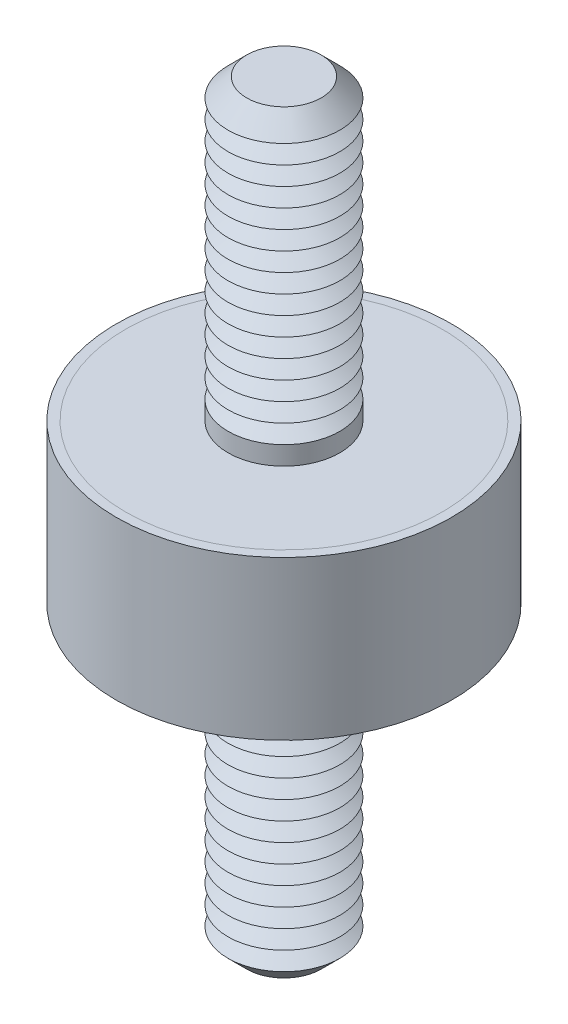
ISO-10303-21;
HEADER;
FILE_DESCRIPTION(('STEP AP214'),'2;1');
FILE_NAME('part.step','',(''),(''),'','','');
FILE_SCHEMA(('AUTOMOTIVE_DESIGN { 1 0 10303 214 1 1 1 1 }'));
ENDSEC;
DATA;
#1=APPLICATION_CONTEXT('core data for automotive mechanical design processes');
#2=APPLICATION_PROTOCOL_DEFINITION('international standard','automotive_design',2000,#1);
#3=PRODUCT_CONTEXT('',#1,'mechanical');
#4=PRODUCT('Part','Part','',(#3));
#5=PRODUCT_RELATED_PRODUCT_CATEGORY('part','',(#4));
#6=PRODUCT_DEFINITION_FORMATION('','',#4);
#7=PRODUCT_DEFINITION_CONTEXT('part definition',#1,'design');
#8=PRODUCT_DEFINITION('design','',#6,#7);
#9=PRODUCT_DEFINITION_SHAPE('','',#8);
#10=(LENGTH_UNIT() NAMED_UNIT(*) SI_UNIT(.MILLI.,.METRE.));
#11=(NAMED_UNIT(*) PLANE_ANGLE_UNIT() SI_UNIT($,.RADIAN.));
#12=(NAMED_UNIT(*) SI_UNIT($,.STERADIAN.) SOLID_ANGLE_UNIT());
#13=UNCERTAINTY_MEASURE_WITH_UNIT(LENGTH_MEASURE(1.E-05),#10,'distance_accuracy_value','');
#14=(GEOMETRIC_REPRESENTATION_CONTEXT(3) GLOBAL_UNCERTAINTY_ASSIGNED_CONTEXT((#13)) GLOBAL_UNIT_ASSIGNED_CONTEXT((#10,
#11,#12)) REPRESENTATION_CONTEXT('',''));
#15=CARTESIAN_POINT('',(0.,0.,0.));
#16=DIRECTION('',(0.,0.,1.));
#17=DIRECTION('',(1.,0.,0.));
#18=AXIS2_PLACEMENT_3D('',#15,#16,#17);
#19=CARTESIAN_POINT('',(0.,-20.25,0.));
#20=DIRECTION('',(0.,1.,0.));
#21=DIRECTION('',(0.,0.,1.));
#22=AXIS2_PLACEMENT_3D('',#19,#20,#21);
#23=CYLINDRICAL_SURFACE('',#22,3.);
#24=CARTESIAN_POINT('',(0.,-4.25,0.));
#25=DIRECTION('',(0.,-1.,0.));
#26=DIRECTION('',(0.,0.,-1.));
#27=AXIS2_PLACEMENT_3D('',#24,#25,#26);
#28=CIRCLE('',#27,3.);
#29=CARTESIAN_POINT('',(0.,-4.25,-3.));
#30=VERTEX_POINT('',#29);
#31=EDGE_CURVE('P0_E21',#30,#30,#28,.T.);
#32=ORIENTED_EDGE('',*,*,#31,.T.);
#33=EDGE_LOOP('',(#32));
#34=FACE_BOUND('',#33,.T.);
#35=CARTESIAN_POINT('',(0.,-5.25,0.));
#36=DIRECTION('',(0.,1.,0.));
#37=DIRECTION('',(0.,0.,1.));
#38=AXIS2_PLACEMENT_3D('',#35,#36,#37);
#39=CIRCLE('',#38,3.);
#40=CARTESIAN_POINT('',(0.,-5.25,3.));
#41=VERTEX_POINT('',#40);
#42=EDGE_CURVE('P0_E33',#41,#41,#39,.T.);
#43=ORIENTED_EDGE('',*,*,#42,.T.);
#44=EDGE_LOOP('',(#43));
#45=FACE_BOUND('',#44,.T.);
#46=ADVANCED_FACE('P0_F14',(#34,#45),#23,.T.);
#47=CARTESIAN_POINT('',(0.,-4.25,0.));
#48=DIRECTION('',(0.,1.,0.));
#49=DIRECTION('',(0.,0.,1.));
#50=AXIS2_PLACEMENT_3D('',#47,#48,#49);
#51=CYLINDRICAL_SURFACE('',#50,8.5);
#52=CARTESIAN_POINT('',(0.,-4.25,0.));
#53=DIRECTION('',(0.,1.,0.));
#54=DIRECTION('',(0.,0.,1.));
#55=AXIS2_PLACEMENT_3D('',#52,#53,#54);
#56=CIRCLE('',#55,8.5);
#57=CARTESIAN_POINT('',(0.,-4.25,8.5));
#58=VERTEX_POINT('',#57);
#59=EDGE_CURVE('P0_E25',#58,#58,#56,.T.);
#60=ORIENTED_EDGE('',*,*,#59,.T.);
#61=EDGE_LOOP('',(#60));
#62=FACE_BOUND('',#61,.T.);
#63=CARTESIAN_POINT('',(0.,-3.75,0.));
#64=DIRECTION('',(0.,1.,0.));
#65=DIRECTION('',(0.,0.,1.));
#66=AXIS2_PLACEMENT_3D('',#63,#64,#65);
#67=CIRCLE('',#66,8.5);
#68=CARTESIAN_POINT('',(0.,-3.75,8.5));
#69=VERTEX_POINT('',#68);
#70=EDGE_CURVE('P0_E30',#69,#69,#67,.T.);
#71=ORIENTED_EDGE('',*,*,#70,.F.);
#72=EDGE_LOOP('',(#71));
#73=FACE_BOUND('',#72,.T.);
#74=ADVANCED_FACE('P0_F145',(#62,#73),#51,.T.);
#75=CARTESIAN_POINT('',(0.,-4.25,0.));
#76=DIRECTION('',(0.,1.,0.));
#77=DIRECTION('',(0.,0.,1.));
#78=AXIS2_PLACEMENT_3D('',#75,#76,#77);
#79=PLANE('',#78);
#80=ORIENTED_EDGE('',*,*,#31,.F.);
#81=EDGE_LOOP('',(#80));
#82=FACE_BOUND('',#81,.T.);
#83=ORIENTED_EDGE('',*,*,#59,.F.);
#84=EDGE_LOOP('',(#83));
#85=FACE_BOUND('',#84,.T.);
#86=ADVANCED_FACE('P0_F150',(#82,#85),#79,.F.);
#87=CARTESIAN_POINT('',(0.,-3.75,0.));
#88=DIRECTION('',(0.,1.,0.));
#89=DIRECTION('',(0.,0.,1.));
#90=AXIS2_PLACEMENT_3D('',#87,#88,#89);
#91=PLANE('',#90);
#92=ORIENTED_EDGE('',*,*,#70,.T.);
#93=EDGE_LOOP('',(#92));
#94=FACE_BOUND('',#93,.T.);
#95=ADVANCED_FACE('P0_F156',(#94),#91,.T.);
#96=CARTESIAN_POINT('',(0.,-5.25,0.));
#97=DIRECTION('',(0.,1.,0.));
#98=DIRECTION('',(0.,0.,1.));
#99=AXIS2_PLACEMENT_3D('',#96,#97,#98);
#100=CONICAL_SURFACE('',#99,3.,1.0471975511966);
#101=CARTESIAN_POINT('',(0.,-5.75,0.));
#102=DIRECTION('',(0.,1.,0.));
#103=DIRECTION('',(0.,0.,1.));
#104=AXIS2_PLACEMENT_3D('',#101,#102,#103);
#105=CIRCLE('',#104,2.13397459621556);
#106=CARTESIAN_POINT('',(0.,-5.75,2.13397459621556));
#107=VERTEX_POINT('',#106);
#108=EDGE_CURVE('P0_E39',#107,#107,#105,.T.);
#109=ORIENTED_EDGE('',*,*,#108,.T.);
#110=EDGE_LOOP('',(#109));
#111=FACE_BOUND('',#110,.T.);
#112=ORIENTED_EDGE('',*,*,#42,.F.);
#113=EDGE_LOOP('',(#112));
#114=FACE_BOUND('',#113,.T.);
#115=ADVANCED_FACE('P0_F159',(#111,#114),#100,.T.);
#116=CARTESIAN_POINT('',(0.,-5.75,0.));
#117=DIRECTION('',(0.,-1.,0.));
#118=DIRECTION('',(0.,0.,-1.));
#119=AXIS2_PLACEMENT_3D('',#116,#117,#118);
#120=CONICAL_SURFACE('',#119,2.13397459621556,1.0471975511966);
#121=CARTESIAN_POINT('',(0.,-6.25,0.));
#122=DIRECTION('',(0.,1.,0.));
#123=DIRECTION('',(0.,0.,1.));
#124=AXIS2_PLACEMENT_3D('',#121,#122,#123);
#125=CIRCLE('',#124,3.);
#126=CARTESIAN_POINT('',(0.,-6.25,3.));
#127=VERTEX_POINT('',#126);
#128=EDGE_CURVE('P0_E43',#127,#127,#125,.T.);
#129=ORIENTED_EDGE('',*,*,#128,.T.);
#130=EDGE_LOOP('',(#129));
#131=FACE_BOUND('',#130,.T.);
#132=ORIENTED_EDGE('',*,*,#108,.F.);
#133=EDGE_LOOP('',(#132));
#134=FACE_BOUND('',#133,.T.);
#135=ADVANCED_FACE('P0_F163',(#131,#134),#120,.T.);
#136=CARTESIAN_POINT('',(0.,-6.25,0.));
#137=DIRECTION('',(0.,1.,0.));
#138=DIRECTION('',(0.,0.,1.));
#139=AXIS2_PLACEMENT_3D('',#136,#137,#138);
#140=CONICAL_SURFACE('',#139,3.,1.0471975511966);
#141=CARTESIAN_POINT('',(0.,-6.75,0.));
#142=DIRECTION('',(0.,1.,0.));
#143=DIRECTION('',(0.,0.,1.));
#144=AXIS2_PLACEMENT_3D('',#141,#142,#143);
#145=CIRCLE('',#144,2.13397459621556);
#146=CARTESIAN_POINT('',(0.,-6.75,2.13397459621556));
#147=VERTEX_POINT('',#146);
#148=EDGE_CURVE('P0_E47',#147,#147,#145,.T.);
#149=ORIENTED_EDGE('',*,*,#148,.T.);
#150=EDGE_LOOP('',(#149));
#151=FACE_BOUND('',#150,.T.);
#152=ORIENTED_EDGE('',*,*,#128,.F.);
#153=EDGE_LOOP('',(#152));
#154=FACE_BOUND('',#153,.T.);
#155=ADVANCED_FACE('P0_F167',(#151,#154),#140,.T.);
#156=CARTESIAN_POINT('',(0.,-6.75,0.));
#157=DIRECTION('',(0.,-1.,0.));
#158=DIRECTION('',(0.,0.,-1.));
#159=AXIS2_PLACEMENT_3D('',#156,#157,#158);
#160=CONICAL_SURFACE('',#159,2.13397459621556,1.0471975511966);
#161=CARTESIAN_POINT('',(0.,-7.25,0.));
#162=DIRECTION('',(0.,1.,0.));
#163=DIRECTION('',(0.,0.,1.));
#164=AXIS2_PLACEMENT_3D('',#161,#162,#163);
#165=CIRCLE('',#164,3.);
#166=CARTESIAN_POINT('',(0.,-7.25,3.));
#167=VERTEX_POINT('',#166);
#168=EDGE_CURVE('P0_E52',#167,#167,#165,.T.);
#169=ORIENTED_EDGE('',*,*,#168,.T.);
#170=EDGE_LOOP('',(#169));
#171=FACE_BOUND('',#170,.T.);
#172=ORIENTED_EDGE('',*,*,#148,.F.);
#173=EDGE_LOOP('',(#172));
#174=FACE_BOUND('',#173,.T.);
#175=ADVANCED_FACE('P0_F174',(#171,#174),#160,.T.);
#176=CARTESIAN_POINT('',(0.,-7.25,0.));
#177=DIRECTION('',(0.,1.,0.));
#178=DIRECTION('',(0.,0.,1.));
#179=AXIS2_PLACEMENT_3D('',#176,#177,#178);
#180=CONICAL_SURFACE('',#179,3.,1.0471975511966);
#181=CARTESIAN_POINT('',(0.,-7.75,0.));
#182=DIRECTION('',(0.,1.,0.));
#183=DIRECTION('',(0.,0.,1.));
#184=AXIS2_PLACEMENT_3D('',#181,#182,#183);
#185=CIRCLE('',#184,2.13397459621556);
#186=CARTESIAN_POINT('',(0.,-7.75,2.13397459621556));
#187=VERTEX_POINT('',#186);
#188=EDGE_CURVE('P0_E55',#187,#187,#185,.T.);
#189=ORIENTED_EDGE('',*,*,#188,.T.);
#190=EDGE_LOOP('',(#189));
#191=FACE_BOUND('',#190,.T.);
#192=ORIENTED_EDGE('',*,*,#168,.F.);
#193=EDGE_LOOP('',(#192));
#194=FACE_BOUND('',#193,.T.);
#195=ADVANCED_FACE('P0_F178',(#191,#194),#180,.T.);
#196=CARTESIAN_POINT('',(0.,-7.75,0.));
#197=DIRECTION('',(0.,-1.,0.));
#198=DIRECTION('',(0.,0.,-1.));
#199=AXIS2_PLACEMENT_3D('',#196,#197,#198);
#200=CONICAL_SURFACE('',#199,2.13397459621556,1.0471975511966);
#201=CARTESIAN_POINT('',(0.,-8.25,0.));
#202=DIRECTION('',(0.,1.,0.));
#203=DIRECTION('',(0.,0.,1.));
#204=AXIS2_PLACEMENT_3D('',#201,#202,#203);
#205=CIRCLE('',#204,3.);
#206=CARTESIAN_POINT('',(0.,-8.25,3.));
#207=VERTEX_POINT('',#206);
#208=EDGE_CURVE('P0_E58',#207,#207,#205,.T.);
#209=ORIENTED_EDGE('',*,*,#208,.T.);
#210=EDGE_LOOP('',(#209));
#211=FACE_BOUND('',#210,.T.);
#212=ORIENTED_EDGE('',*,*,#188,.F.);
#213=EDGE_LOOP('',(#212));
#214=FACE_BOUND('',#213,.T.);
#215=ADVANCED_FACE('P0_F182',(#211,#214),#200,.T.);
#216=CARTESIAN_POINT('',(0.,-8.25,0.));
#217=DIRECTION('',(0.,1.,0.));
#218=DIRECTION('',(0.,0.,1.));
#219=AXIS2_PLACEMENT_3D('',#216,#217,#218);
#220=CONICAL_SURFACE('',#219,3.,1.0471975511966);
#221=CARTESIAN_POINT('',(0.,-8.75,0.));
#222=DIRECTION('',(0.,1.,0.));
#223=DIRECTION('',(0.,0.,1.));
#224=AXIS2_PLACEMENT_3D('',#221,#222,#223);
#225=CIRCLE('',#224,2.13397459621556);
#226=CARTESIAN_POINT('',(0.,-8.75,2.13397459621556));
#227=VERTEX_POINT('',#226);
#228=EDGE_CURVE('P0_E61',#227,#227,#225,.T.);
#229=ORIENTED_EDGE('',*,*,#228,.T.);
#230=EDGE_LOOP('',(#229));
#231=FACE_BOUND('',#230,.T.);
#232=ORIENTED_EDGE('',*,*,#208,.F.);
#233=EDGE_LOOP('',(#232));
#234=FACE_BOUND('',#233,.T.);
#235=ADVANCED_FACE('P0_F186',(#231,#234),#220,.T.);
#236=CARTESIAN_POINT('',(0.,-8.75,0.));
#237=DIRECTION('',(0.,-1.,0.));
#238=DIRECTION('',(0.,0.,-1.));
#239=AXIS2_PLACEMENT_3D('',#236,#237,#238);
#240=CONICAL_SURFACE('',#239,2.13397459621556,1.0471975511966);
#241=CARTESIAN_POINT('',(0.,-9.25,0.));
#242=DIRECTION('',(0.,1.,0.));
#243=DIRECTION('',(0.,0.,1.));
#244=AXIS2_PLACEMENT_3D('',#241,#242,#243);
#245=CIRCLE('',#244,3.);
#246=CARTESIAN_POINT('',(0.,-9.25,3.));
#247=VERTEX_POINT('',#246);
#248=EDGE_CURVE('P0_E64',#247,#247,#245,.T.);
#249=ORIENTED_EDGE('',*,*,#248,.T.);
#250=EDGE_LOOP('',(#249));
#251=FACE_BOUND('',#250,.T.);
#252=ORIENTED_EDGE('',*,*,#228,.F.);
#253=EDGE_LOOP('',(#252));
#254=FACE_BOUND('',#253,.T.);
#255=ADVANCED_FACE('P0_F190',(#251,#254),#240,.T.);
#256=CARTESIAN_POINT('',(0.,-9.25,0.));
#257=DIRECTION('',(0.,1.,0.));
#258=DIRECTION('',(0.,0.,1.));
#259=AXIS2_PLACEMENT_3D('',#256,#257,#258);
#260=CONICAL_SURFACE('',#259,3.,1.0471975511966);
#261=CARTESIAN_POINT('',(0.,-9.75,0.));
#262=DIRECTION('',(0.,1.,0.));
#263=DIRECTION('',(0.,0.,1.));
#264=AXIS2_PLACEMENT_3D('',#261,#262,#263);
#265=CIRCLE('',#264,2.13397459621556);
#266=CARTESIAN_POINT('',(0.,-9.75,2.13397459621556));
#267=VERTEX_POINT('',#266);
#268=EDGE_CURVE('P0_E67',#267,#267,#265,.T.);
#269=ORIENTED_EDGE('',*,*,#268,.T.);
#270=EDGE_LOOP('',(#269));
#271=FACE_BOUND('',#270,.T.);
#272=ORIENTED_EDGE('',*,*,#248,.F.);
#273=EDGE_LOOP('',(#272));
#274=FACE_BOUND('',#273,.T.);
#275=ADVANCED_FACE('P0_F194',(#271,#274),#260,.T.);
#276=CARTESIAN_POINT('',(0.,-9.75,0.));
#277=DIRECTION('',(0.,-1.,0.));
#278=DIRECTION('',(0.,0.,-1.));
#279=AXIS2_PLACEMENT_3D('',#276,#277,#278);
#280=CONICAL_SURFACE('',#279,2.13397459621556,1.0471975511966);
#281=CARTESIAN_POINT('',(0.,-10.25,0.));
#282=DIRECTION('',(0.,1.,0.));
#283=DIRECTION('',(0.,0.,1.));
#284=AXIS2_PLACEMENT_3D('',#281,#282,#283);
#285=CIRCLE('',#284,3.);
#286=CARTESIAN_POINT('',(0.,-10.25,3.));
#287=VERTEX_POINT('',#286);
#288=EDGE_CURVE('P0_E70',#287,#287,#285,.T.);
#289=ORIENTED_EDGE('',*,*,#288,.T.);
#290=EDGE_LOOP('',(#289));
#291=FACE_BOUND('',#290,.T.);
#292=ORIENTED_EDGE('',*,*,#268,.F.);
#293=EDGE_LOOP('',(#292));
#294=FACE_BOUND('',#293,.T.);
#295=ADVANCED_FACE('P0_F198',(#291,#294),#280,.T.);
#296=CARTESIAN_POINT('',(0.,-10.25,0.));
#297=DIRECTION('',(0.,1.,0.));
#298=DIRECTION('',(0.,0.,1.));
#299=AXIS2_PLACEMENT_3D('',#296,#297,#298);
#300=CONICAL_SURFACE('',#299,3.,1.0471975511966);
#301=CARTESIAN_POINT('',(0.,-10.75,0.));
#302=DIRECTION('',(0.,1.,0.));
#303=DIRECTION('',(0.,0.,1.));
#304=AXIS2_PLACEMENT_3D('',#301,#302,#303);
#305=CIRCLE('',#304,2.13397459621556);
#306=CARTESIAN_POINT('',(0.,-10.75,2.13397459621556));
#307=VERTEX_POINT('',#306);
#308=EDGE_CURVE('P0_E73',#307,#307,#305,.T.);
#309=ORIENTED_EDGE('',*,*,#308,.T.);
#310=EDGE_LOOP('',(#309));
#311=FACE_BOUND('',#310,.T.);
#312=ORIENTED_EDGE('',*,*,#288,.F.);
#313=EDGE_LOOP('',(#312));
#314=FACE_BOUND('',#313,.T.);
#315=ADVANCED_FACE('P0_F202',(#311,#314),#300,.T.);
#316=CARTESIAN_POINT('',(0.,-10.75,0.));
#317=DIRECTION('',(0.,-1.,0.));
#318=DIRECTION('',(0.,0.,-1.));
#319=AXIS2_PLACEMENT_3D('',#316,#317,#318);
#320=CONICAL_SURFACE('',#319,2.13397459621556,1.0471975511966);
#321=CARTESIAN_POINT('',(0.,-11.25,0.));
#322=DIRECTION('',(0.,1.,0.));
#323=DIRECTION('',(0.,0.,1.));
#324=AXIS2_PLACEMENT_3D('',#321,#322,#323);
#325=CIRCLE('',#324,3.);
#326=CARTESIAN_POINT('',(0.,-11.25,3.));
#327=VERTEX_POINT('',#326);
#328=EDGE_CURVE('P0_E76',#327,#327,#325,.T.);
#329=ORIENTED_EDGE('',*,*,#328,.T.);
#330=EDGE_LOOP('',(#329));
#331=FACE_BOUND('',#330,.T.);
#332=ORIENTED_EDGE('',*,*,#308,.F.);
#333=EDGE_LOOP('',(#332));
#334=FACE_BOUND('',#333,.T.);
#335=ADVANCED_FACE('P0_F206',(#331,#334),#320,.T.);
#336=CARTESIAN_POINT('',(0.,-11.25,0.));
#337=DIRECTION('',(0.,1.,0.));
#338=DIRECTION('',(0.,0.,1.));
#339=AXIS2_PLACEMENT_3D('',#336,#337,#338);
#340=CONICAL_SURFACE('',#339,3.,1.0471975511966);
#341=CARTESIAN_POINT('',(0.,-11.75,0.));
#342=DIRECTION('',(0.,1.,0.));
#343=DIRECTION('',(0.,0.,1.));
#344=AXIS2_PLACEMENT_3D('',#341,#342,#343);
#345=CIRCLE('',#344,2.13397459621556);
#346=CARTESIAN_POINT('',(0.,-11.75,2.13397459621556));
#347=VERTEX_POINT('',#346);
#348=EDGE_CURVE('P0_E79',#347,#347,#345,.T.);
#349=ORIENTED_EDGE('',*,*,#348,.T.);
#350=EDGE_LOOP('',(#349));
#351=FACE_BOUND('',#350,.T.);
#352=ORIENTED_EDGE('',*,*,#328,.F.);
#353=EDGE_LOOP('',(#352));
#354=FACE_BOUND('',#353,.T.);
#355=ADVANCED_FACE('P0_F210',(#351,#354),#340,.T.);
#356=CARTESIAN_POINT('',(0.,-11.75,0.));
#357=DIRECTION('',(0.,-1.,0.));
#358=DIRECTION('',(0.,0.,-1.));
#359=AXIS2_PLACEMENT_3D('',#356,#357,#358);
#360=CONICAL_SURFACE('',#359,2.13397459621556,1.0471975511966);
#361=CARTESIAN_POINT('',(0.,-12.25,0.));
#362=DIRECTION('',(0.,1.,0.));
#363=DIRECTION('',(0.,0.,1.));
#364=AXIS2_PLACEMENT_3D('',#361,#362,#363);
#365=CIRCLE('',#364,3.);
#366=CARTESIAN_POINT('',(0.,-12.25,3.));
#367=VERTEX_POINT('',#366);
#368=EDGE_CURVE('P0_E82',#367,#367,#365,.T.);
#369=ORIENTED_EDGE('',*,*,#368,.T.);
#370=EDGE_LOOP('',(#369));
#371=FACE_BOUND('',#370,.T.);
#372=ORIENTED_EDGE('',*,*,#348,.F.);
#373=EDGE_LOOP('',(#372));
#374=FACE_BOUND('',#373,.T.);
#375=ADVANCED_FACE('P0_F214',(#371,#374),#360,.T.);
#376=CARTESIAN_POINT('',(0.,-12.25,0.));
#377=DIRECTION('',(0.,1.,0.));
#378=DIRECTION('',(0.,0.,1.));
#379=AXIS2_PLACEMENT_3D('',#376,#377,#378);
#380=CONICAL_SURFACE('',#379,3.,1.0471975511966);
#381=CARTESIAN_POINT('',(0.,-12.75,0.));
#382=DIRECTION('',(0.,1.,0.));
#383=DIRECTION('',(0.,0.,1.));
#384=AXIS2_PLACEMENT_3D('',#381,#382,#383);
#385=CIRCLE('',#384,2.13397459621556);
#386=CARTESIAN_POINT('',(0.,-12.75,2.13397459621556));
#387=VERTEX_POINT('',#386);
#388=EDGE_CURVE('P0_E85',#387,#387,#385,.T.);
#389=ORIENTED_EDGE('',*,*,#388,.T.);
#390=EDGE_LOOP('',(#389));
#391=FACE_BOUND('',#390,.T.);
#392=ORIENTED_EDGE('',*,*,#368,.F.);
#393=EDGE_LOOP('',(#392));
#394=FACE_BOUND('',#393,.T.);
#395=ADVANCED_FACE('P0_F218',(#391,#394),#380,.T.);
#396=CARTESIAN_POINT('',(0.,-12.75,0.));
#397=DIRECTION('',(0.,-1.,0.));
#398=DIRECTION('',(0.,0.,-1.));
#399=AXIS2_PLACEMENT_3D('',#396,#397,#398);
#400=CONICAL_SURFACE('',#399,2.13397459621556,1.0471975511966);
#401=CARTESIAN_POINT('',(0.,-13.25,0.));
#402=DIRECTION('',(0.,1.,0.));
#403=DIRECTION('',(0.,0.,1.));
#404=AXIS2_PLACEMENT_3D('',#401,#402,#403);
#405=CIRCLE('',#404,3.);
#406=CARTESIAN_POINT('',(0.,-13.25,3.));
#407=VERTEX_POINT('',#406);
#408=EDGE_CURVE('P0_E88',#407,#407,#405,.T.);
#409=ORIENTED_EDGE('',*,*,#408,.T.);
#410=EDGE_LOOP('',(#409));
#411=FACE_BOUND('',#410,.T.);
#412=ORIENTED_EDGE('',*,*,#388,.F.);
#413=EDGE_LOOP('',(#412));
#414=FACE_BOUND('',#413,.T.);
#415=ADVANCED_FACE('P0_F222',(#411,#414),#400,.T.);
#416=CARTESIAN_POINT('',(0.,-13.25,0.));
#417=DIRECTION('',(0.,1.,0.));
#418=DIRECTION('',(0.,0.,1.));
#419=AXIS2_PLACEMENT_3D('',#416,#417,#418);
#420=CONICAL_SURFACE('',#419,3.,1.0471975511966);
#421=CARTESIAN_POINT('',(0.,-13.75,0.));
#422=DIRECTION('',(0.,1.,0.));
#423=DIRECTION('',(0.,0.,1.));
#424=AXIS2_PLACEMENT_3D('',#421,#422,#423);
#425=CIRCLE('',#424,2.13397459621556);
#426=CARTESIAN_POINT('',(0.,-13.75,2.13397459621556));
#427=VERTEX_POINT('',#426);
#428=EDGE_CURVE('P0_E91',#427,#427,#425,.T.);
#429=ORIENTED_EDGE('',*,*,#428,.T.);
#430=EDGE_LOOP('',(#429));
#431=FACE_BOUND('',#430,.T.);
#432=ORIENTED_EDGE('',*,*,#408,.F.);
#433=EDGE_LOOP('',(#432));
#434=FACE_BOUND('',#433,.T.);
#435=ADVANCED_FACE('P0_F226',(#431,#434),#420,.T.);
#436=CARTESIAN_POINT('',(0.,-13.75,0.));
#437=DIRECTION('',(0.,-1.,0.));
#438=DIRECTION('',(0.,0.,-1.));
#439=AXIS2_PLACEMENT_3D('',#436,#437,#438);
#440=CONICAL_SURFACE('',#439,2.13397459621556,1.0471975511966);
#441=CARTESIAN_POINT('',(0.,-14.25,0.));
#442=DIRECTION('',(0.,1.,0.));
#443=DIRECTION('',(0.,0.,1.));
#444=AXIS2_PLACEMENT_3D('',#441,#442,#443);
#445=CIRCLE('',#444,3.);
#446=CARTESIAN_POINT('',(0.,-14.25,3.));
#447=VERTEX_POINT('',#446);
#448=EDGE_CURVE('P0_E94',#447,#447,#445,.T.);
#449=ORIENTED_EDGE('',*,*,#448,.T.);
#450=EDGE_LOOP('',(#449));
#451=FACE_BOUND('',#450,.T.);
#452=ORIENTED_EDGE('',*,*,#428,.F.);
#453=EDGE_LOOP('',(#452));
#454=FACE_BOUND('',#453,.T.);
#455=ADVANCED_FACE('P0_F230',(#451,#454),#440,.T.);
#456=CARTESIAN_POINT('',(0.,-14.25,0.));
#457=DIRECTION('',(0.,1.,0.));
#458=DIRECTION('',(0.,0.,1.));
#459=AXIS2_PLACEMENT_3D('',#456,#457,#458);
#460=CONICAL_SURFACE('',#459,3.,1.0471975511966);
#461=CARTESIAN_POINT('',(0.,-14.75,0.));
#462=DIRECTION('',(0.,1.,0.));
#463=DIRECTION('',(0.,0.,1.));
#464=AXIS2_PLACEMENT_3D('',#461,#462,#463);
#465=CIRCLE('',#464,2.13397459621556);
#466=CARTESIAN_POINT('',(0.,-14.75,2.13397459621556));
#467=VERTEX_POINT('',#466);
#468=EDGE_CURVE('P0_E97',#467,#467,#465,.T.);
#469=ORIENTED_EDGE('',*,*,#468,.T.);
#470=EDGE_LOOP('',(#469));
#471=FACE_BOUND('',#470,.T.);
#472=ORIENTED_EDGE('',*,*,#448,.F.);
#473=EDGE_LOOP('',(#472));
#474=FACE_BOUND('',#473,.T.);
#475=ADVANCED_FACE('P0_F234',(#471,#474),#460,.T.);
#476=CARTESIAN_POINT('',(0.,-14.75,0.));
#477=DIRECTION('',(0.,-1.,0.));
#478=DIRECTION('',(0.,0.,-1.));
#479=AXIS2_PLACEMENT_3D('',#476,#477,#478);
#480=CONICAL_SURFACE('',#479,2.13397459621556,1.0471975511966);
#481=CARTESIAN_POINT('',(0.,-15.25,0.));
#482=DIRECTION('',(0.,1.,0.));
#483=DIRECTION('',(0.,0.,1.));
#484=AXIS2_PLACEMENT_3D('',#481,#482,#483);
#485=CIRCLE('',#484,3.);
#486=CARTESIAN_POINT('',(0.,-15.25,3.));
#487=VERTEX_POINT('',#486);
#488=EDGE_CURVE('P0_E100',#487,#487,#485,.T.);
#489=ORIENTED_EDGE('',*,*,#488,.T.);
#490=EDGE_LOOP('',(#489));
#491=FACE_BOUND('',#490,.T.);
#492=ORIENTED_EDGE('',*,*,#468,.F.);
#493=EDGE_LOOP('',(#492));
#494=FACE_BOUND('',#493,.T.);
#495=ADVANCED_FACE('P0_F238',(#491,#494),#480,.T.);
#496=CARTESIAN_POINT('',(0.,-15.25,0.));
#497=DIRECTION('',(0.,1.,0.));
#498=DIRECTION('',(0.,0.,1.));
#499=AXIS2_PLACEMENT_3D('',#496,#497,#498);
#500=CONICAL_SURFACE('',#499,3.,1.0471975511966);
#501=CARTESIAN_POINT('',(0.,-15.75,0.));
#502=DIRECTION('',(0.,1.,0.));
#503=DIRECTION('',(0.,0.,1.));
#504=AXIS2_PLACEMENT_3D('',#501,#502,#503);
#505=CIRCLE('',#504,2.13397459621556);
#506=CARTESIAN_POINT('',(0.,-15.75,2.13397459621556));
#507=VERTEX_POINT('',#506);
#508=EDGE_CURVE('P0_E103',#507,#507,#505,.T.);
#509=ORIENTED_EDGE('',*,*,#508,.T.);
#510=EDGE_LOOP('',(#509));
#511=FACE_BOUND('',#510,.T.);
#512=ORIENTED_EDGE('',*,*,#488,.F.);
#513=EDGE_LOOP('',(#512));
#514=FACE_BOUND('',#513,.T.);
#515=ADVANCED_FACE('P0_F242',(#511,#514),#500,.T.);
#516=CARTESIAN_POINT('',(0.,-15.75,0.));
#517=DIRECTION('',(0.,-1.,0.));
#518=DIRECTION('',(0.,0.,-1.));
#519=AXIS2_PLACEMENT_3D('',#516,#517,#518);
#520=CONICAL_SURFACE('',#519,2.13397459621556,1.0471975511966);
#521=CARTESIAN_POINT('',(0.,-16.25,0.));
#522=DIRECTION('',(0.,1.,0.));
#523=DIRECTION('',(0.,0.,1.));
#524=AXIS2_PLACEMENT_3D('',#521,#522,#523);
#525=CIRCLE('',#524,3.);
#526=CARTESIAN_POINT('',(0.,-16.25,3.));
#527=VERTEX_POINT('',#526);
#528=EDGE_CURVE('P0_E106',#527,#527,#525,.T.);
#529=ORIENTED_EDGE('',*,*,#528,.T.);
#530=EDGE_LOOP('',(#529));
#531=FACE_BOUND('',#530,.T.);
#532=ORIENTED_EDGE('',*,*,#508,.F.);
#533=EDGE_LOOP('',(#532));
#534=FACE_BOUND('',#533,.T.);
#535=ADVANCED_FACE('P0_F246',(#531,#534),#520,.T.);
#536=CARTESIAN_POINT('',(0.,-16.25,0.));
#537=DIRECTION('',(0.,1.,0.));
#538=DIRECTION('',(0.,0.,1.));
#539=AXIS2_PLACEMENT_3D('',#536,#537,#538);
#540=CONICAL_SURFACE('',#539,3.,1.0471975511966);
#541=CARTESIAN_POINT('',(0.,-16.75,0.));
#542=DIRECTION('',(0.,1.,0.));
#543=DIRECTION('',(0.,0.,1.));
#544=AXIS2_PLACEMENT_3D('',#541,#542,#543);
#545=CIRCLE('',#544,2.13397459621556);
#546=CARTESIAN_POINT('',(0.,-16.75,2.13397459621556));
#547=VERTEX_POINT('',#546);
#548=EDGE_CURVE('P0_E109',#547,#547,#545,.T.);
#549=ORIENTED_EDGE('',*,*,#548,.T.);
#550=EDGE_LOOP('',(#549));
#551=FACE_BOUND('',#550,.T.);
#552=ORIENTED_EDGE('',*,*,#528,.F.);
#553=EDGE_LOOP('',(#552));
#554=FACE_BOUND('',#553,.T.);
#555=ADVANCED_FACE('P0_F250',(#551,#554),#540,.T.);
#556=CARTESIAN_POINT('',(0.,-16.75,0.));
#557=DIRECTION('',(0.,-1.,0.));
#558=DIRECTION('',(0.,0.,-1.));
#559=AXIS2_PLACEMENT_3D('',#556,#557,#558);
#560=CONICAL_SURFACE('',#559,2.13397459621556,1.0471975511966);
#561=CARTESIAN_POINT('',(0.,-17.25,0.));
#562=DIRECTION('',(0.,1.,0.));
#563=DIRECTION('',(0.,0.,1.));
#564=AXIS2_PLACEMENT_3D('',#561,#562,#563);
#565=CIRCLE('',#564,3.);
#566=CARTESIAN_POINT('',(0.,-17.25,3.));
#567=VERTEX_POINT('',#566);
#568=EDGE_CURVE('P0_E112',#567,#567,#565,.T.);
#569=ORIENTED_EDGE('',*,*,#568,.T.);
#570=EDGE_LOOP('',(#569));
#571=FACE_BOUND('',#570,.T.);
#572=ORIENTED_EDGE('',*,*,#548,.F.);
#573=EDGE_LOOP('',(#572));
#574=FACE_BOUND('',#573,.T.);
#575=ADVANCED_FACE('P0_F254',(#571,#574),#560,.T.);
#576=CARTESIAN_POINT('',(0.,-17.25,0.));
#577=DIRECTION('',(0.,1.,0.));
#578=DIRECTION('',(0.,0.,1.));
#579=AXIS2_PLACEMENT_3D('',#576,#577,#578);
#580=CONICAL_SURFACE('',#579,3.,1.0471975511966);
#581=CARTESIAN_POINT('',(0.,-17.75,0.));
#582=DIRECTION('',(0.,1.,0.));
#583=DIRECTION('',(0.,0.,1.));
#584=AXIS2_PLACEMENT_3D('',#581,#582,#583);
#585=CIRCLE('',#584,2.13397459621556);
#586=CARTESIAN_POINT('',(0.,-17.75,2.13397459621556));
#587=VERTEX_POINT('',#586);
#588=EDGE_CURVE('P0_E115',#587,#587,#585,.T.);
#589=ORIENTED_EDGE('',*,*,#588,.T.);
#590=EDGE_LOOP('',(#589));
#591=FACE_BOUND('',#590,.T.);
#592=ORIENTED_EDGE('',*,*,#568,.F.);
#593=EDGE_LOOP('',(#592));
#594=FACE_BOUND('',#593,.T.);
#595=ADVANCED_FACE('P0_F258',(#591,#594),#580,.T.);
#596=CARTESIAN_POINT('',(0.,-17.75,0.));
#597=DIRECTION('',(0.,-1.,0.));
#598=DIRECTION('',(0.,0.,-1.));
#599=AXIS2_PLACEMENT_3D('',#596,#597,#598);
#600=CONICAL_SURFACE('',#599,2.13397459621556,1.0471975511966);
#601=CARTESIAN_POINT('',(0.,-18.25,0.));
#602=DIRECTION('',(0.,1.,0.));
#603=DIRECTION('',(0.,0.,1.));
#604=AXIS2_PLACEMENT_3D('',#601,#602,#603);
#605=CIRCLE('',#604,3.);
#606=CARTESIAN_POINT('',(0.,-18.25,3.));
#607=VERTEX_POINT('',#606);
#608=EDGE_CURVE('P0_E118',#607,#607,#605,.T.);
#609=ORIENTED_EDGE('',*,*,#608,.T.);
#610=EDGE_LOOP('',(#609));
#611=FACE_BOUND('',#610,.T.);
#612=ORIENTED_EDGE('',*,*,#588,.F.);
#613=EDGE_LOOP('',(#612));
#614=FACE_BOUND('',#613,.T.);
#615=ADVANCED_FACE('P0_F142',(#611,#614),#600,.T.);
#616=CARTESIAN_POINT('',(0.,-18.25,0.));
#617=DIRECTION('',(0.,1.,0.));
#618=DIRECTION('',(0.,0.,1.));
#619=AXIS2_PLACEMENT_3D('',#616,#617,#618);
#620=CONICAL_SURFACE('',#619,3.,1.0471975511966);
#621=CARTESIAN_POINT('',(0.,-18.75,0.));
#622=DIRECTION('',(0.,1.,0.));
#623=DIRECTION('',(0.,0.,1.));
#624=AXIS2_PLACEMENT_3D('',#621,#622,#623);
#625=CIRCLE('',#624,2.13397459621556);
#626=CARTESIAN_POINT('',(0.,-18.75,2.13397459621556));
#627=VERTEX_POINT('',#626);
#628=EDGE_CURVE('P0_E124',#627,#627,#625,.T.);
#629=ORIENTED_EDGE('',*,*,#628,.T.);
#630=EDGE_LOOP('',(#629));
#631=FACE_BOUND('',#630,.T.);
#632=ORIENTED_EDGE('',*,*,#608,.F.);
#633=EDGE_LOOP('',(#632));
#634=FACE_BOUND('',#633,.T.);
#635=ADVANCED_FACE('P0_F128',(#631,#634),#620,.T.);
#636=CARTESIAN_POINT('',(0.,-18.75,0.));
#637=DIRECTION('',(0.,-1.,0.));
#638=DIRECTION('',(0.,0.,-1.));
#639=AXIS2_PLACEMENT_3D('',#636,#637,#638);
#640=CONICAL_SURFACE('',#639,2.13397459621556,1.0471975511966);
#641=CARTESIAN_POINT('',(0.,-19.25,0.));
#642=DIRECTION('',(0.,1.,0.));
#643=DIRECTION('',(0.,0.,1.));
#644=AXIS2_PLACEMENT_3D('',#641,#642,#643);
#645=CIRCLE('',#644,3.);
#646=CARTESIAN_POINT('',(0.,-19.25,3.));
#647=VERTEX_POINT('',#646);
#648=EDGE_CURVE('P0_E121',#647,#647,#645,.T.);
#649=ORIENTED_EDGE('',*,*,#648,.T.);
#650=EDGE_LOOP('',(#649));
#651=FACE_BOUND('',#650,.T.);
#652=ORIENTED_EDGE('',*,*,#628,.F.);
#653=EDGE_LOOP('',(#652));
#654=FACE_BOUND('',#653,.T.);
#655=ADVANCED_FACE('P0_F131',(#651,#654),#640,.T.);
#656=CARTESIAN_POINT('',(0.,-20.25,0.));
#657=DIRECTION('',(0.,-1.,0.));
#658=DIRECTION('',(0.,0.,-1.));
#659=AXIS2_PLACEMENT_3D('',#656,#657,#658);
#660=PLANE('',#659);
#661=CARTESIAN_POINT('',(0.,-20.25,0.));
#662=DIRECTION('',(0.,-1.,0.));
#663=DIRECTION('',(0.,0.,-1.));
#664=AXIS2_PLACEMENT_3D('',#661,#662,#663);
#665=CIRCLE('',#664,2.);
#666=CARTESIAN_POINT('',(0.,-20.25,-2.));
#667=VERTEX_POINT('',#666);
#668=EDGE_CURVE('P0_E10',#667,#667,#665,.T.);
#669=ORIENTED_EDGE('',*,*,#668,.T.);
#670=EDGE_LOOP('',(#669));
#671=FACE_BOUND('',#670,.T.);
#672=ADVANCED_FACE('P0_F133',(#671),#660,.T.);
#673=CARTESIAN_POINT('',(0.,-20.25,0.));
#674=DIRECTION('',(0.,1.,0.));
#675=DIRECTION('',(0.,0.,1.));
#676=AXIS2_PLACEMENT_3D('',#673,#674,#675);
#677=CONICAL_SURFACE('',#676,2.,0.785398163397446);
#678=ORIENTED_EDGE('',*,*,#648,.F.);
#679=EDGE_LOOP('',(#678));
#680=FACE_BOUND('',#679,.T.);
#681=ORIENTED_EDGE('',*,*,#668,.F.);
#682=EDGE_LOOP('',(#681));
#683=FACE_BOUND('',#682,.T.);
#684=ADVANCED_FACE('P0_F16',(#680,#683),#677,.T.);
#685=CLOSED_SHELL('',(#46,#74,#86,#95,#115,#135,#155,#175,#195,#215,#235,#255,#275,#295,#315,
#335,#355,#375,#395,#415,#435,#455,#475,#495,#515,#535,#555,#575,#595,#615,#635,#655,#672,#684));
#686=MANIFOLD_SOLID_BREP('P0_B1',#685);
#687=CARTESIAN_POINT('',(0.,20.25,0.));
#688=DIRECTION('',(0.,-1.,0.));
#689=DIRECTION('',(0.,0.,-1.));
#690=AXIS2_PLACEMENT_3D('',#687,#688,#689);
#691=CYLINDRICAL_SURFACE('',#690,3.);
#692=CARTESIAN_POINT('',(0.,5.25,0.));
#693=DIRECTION('',(0.,1.,0.));
#694=DIRECTION('',(0.,0.,1.));
#695=AXIS2_PLACEMENT_3D('',#692,#693,#694);
#696=CIRCLE('',#695,3.);
#697=CARTESIAN_POINT('',(0.,5.25,3.));
#698=VERTEX_POINT('',#697);
#699=EDGE_CURVE('P1_E33',#698,#698,#696,.T.);
#700=ORIENTED_EDGE('',*,*,#699,.F.);
#701=EDGE_LOOP('',(#700));
#702=FACE_BOUND('',#701,.T.);
#703=CARTESIAN_POINT('',(0.,4.25,0.));
#704=DIRECTION('',(0.,1.,0.));
#705=DIRECTION('',(0.,0.,1.));
#706=AXIS2_PLACEMENT_3D('',#703,#704,#705);
#707=CIRCLE('',#706,3.);
#708=CARTESIAN_POINT('',(0.,4.25,3.));
#709=VERTEX_POINT('',#708);
#710=EDGE_CURVE('P1_E21',#709,#709,#707,.T.);
#711=ORIENTED_EDGE('',*,*,#710,.T.);
#712=EDGE_LOOP('',(#711));
#713=FACE_BOUND('',#712,.T.);
#714=ADVANCED_FACE('P1_F14',(#702,#713),#691,.T.);
#715=CARTESIAN_POINT('',(0.,4.25,0.));
#716=DIRECTION('',(0.,-1.,0.));
#717=DIRECTION('',(0.,0.,-1.));
#718=AXIS2_PLACEMENT_3D('',#715,#716,#717);
#719=CYLINDRICAL_SURFACE('',#718,8.5);
#720=CARTESIAN_POINT('',(0.,4.25,0.));
#721=DIRECTION('',(0.,1.,0.));
#722=DIRECTION('',(0.,0.,1.));
#723=AXIS2_PLACEMENT_3D('',#720,#721,#722);
#724=CIRCLE('',#723,8.5);
#725=CARTESIAN_POINT('',(0.,4.25,8.5));
#726=VERTEX_POINT('',#725);
#727=EDGE_CURVE('P1_E25',#726,#726,#724,.T.);
#728=ORIENTED_EDGE('',*,*,#727,.F.);
#729=EDGE_LOOP('',(#728));
#730=FACE_BOUND('',#729,.T.);
#731=CARTESIAN_POINT('',(0.,3.75,0.));
#732=DIRECTION('',(0.,1.,0.));
#733=DIRECTION('',(0.,0.,1.));
#734=AXIS2_PLACEMENT_3D('',#731,#732,#733);
#735=CIRCLE('',#734,8.5);
#736=CARTESIAN_POINT('',(0.,3.75,8.5));
#737=VERTEX_POINT('',#736);
#738=EDGE_CURVE('P1_E30',#737,#737,#735,.T.);
#739=ORIENTED_EDGE('',*,*,#738,.T.);
#740=EDGE_LOOP('',(#739));
#741=FACE_BOUND('',#740,.T.);
#742=ADVANCED_FACE('P1_F292',(#730,#741),#719,.T.);
#743=CARTESIAN_POINT('',(0.,4.25,0.));
#744=DIRECTION('',(0.,1.,0.));
#745=DIRECTION('',(0.,0.,1.));
#746=AXIS2_PLACEMENT_3D('',#743,#744,#745);
#747=PLANE('',#746);
#748=ORIENTED_EDGE('',*,*,#710,.F.);
#749=EDGE_LOOP('',(#748));
#750=FACE_BOUND('',#749,.T.);
#751=ORIENTED_EDGE('',*,*,#727,.T.);
#752=EDGE_LOOP('',(#751));
#753=FACE_BOUND('',#752,.T.);
#754=ADVANCED_FACE('P1_F298',(#750,#753),#747,.T.);
#755=CARTESIAN_POINT('',(0.,3.75,0.));
#756=DIRECTION('',(0.,1.,0.));
#757=DIRECTION('',(0.,0.,1.));
#758=AXIS2_PLACEMENT_3D('',#755,#756,#757);
#759=PLANE('',#758);
#760=ORIENTED_EDGE('',*,*,#738,.F.);
#761=EDGE_LOOP('',(#760));
#762=FACE_BOUND('',#761,.T.);
#763=ADVANCED_FACE('P1_F288',(#762),#759,.F.);
#764=CARTESIAN_POINT('',(0.,5.25,0.));
#765=DIRECTION('',(0.,-1.,0.));
#766=DIRECTION('',(0.,0.,-1.));
#767=AXIS2_PLACEMENT_3D('',#764,#765,#766);
#768=CONICAL_SURFACE('',#767,3.,1.0471975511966);
#769=CARTESIAN_POINT('',(0.,5.75,0.));
#770=DIRECTION('',(0.,1.,0.));
#771=DIRECTION('',(0.,0.,1.));
#772=AXIS2_PLACEMENT_3D('',#769,#770,#771);
#773=CIRCLE('',#772,2.13397459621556);
#774=CARTESIAN_POINT('',(0.,5.75,2.13397459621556));
#775=VERTEX_POINT('',#774);
#776=EDGE_CURVE('P1_E39',#775,#775,#773,.T.);
#777=ORIENTED_EDGE('',*,*,#776,.F.);
#778=EDGE_LOOP('',(#777));
#779=FACE_BOUND('',#778,.T.);
#780=ORIENTED_EDGE('',*,*,#699,.T.);
#781=EDGE_LOOP('',(#780));
#782=FACE_BOUND('',#781,.T.);
#783=ADVANCED_FACE('P1_F282',(#779,#782),#768,.T.);
#784=CARTESIAN_POINT('',(0.,5.75,0.));
#785=DIRECTION('',(0.,1.,0.));
#786=DIRECTION('',(0.,0.,1.));
#787=AXIS2_PLACEMENT_3D('',#784,#785,#786);
#788=CONICAL_SURFACE('',#787,2.13397459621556,1.0471975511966);
#789=CARTESIAN_POINT('',(0.,6.25,0.));
#790=DIRECTION('',(0.,1.,0.));
#791=DIRECTION('',(0.,0.,1.));
#792=AXIS2_PLACEMENT_3D('',#789,#790,#791);
#793=CIRCLE('',#792,3.);
#794=CARTESIAN_POINT('',(0.,6.25,3.));
#795=VERTEX_POINT('',#794);
#796=EDGE_CURVE('P1_E43',#795,#795,#793,.T.);
#797=ORIENTED_EDGE('',*,*,#796,.F.);
#798=EDGE_LOOP('',(#797));
#799=FACE_BOUND('',#798,.T.);
#800=ORIENTED_EDGE('',*,*,#776,.T.);
#801=EDGE_LOOP('',(#800));
#802=FACE_BOUND('',#801,.T.);
#803=ADVANCED_FACE('P1_F277',(#799,#802),#788,.T.);
#804=CARTESIAN_POINT('',(0.,6.25,0.));
#805=DIRECTION('',(0.,-1.,0.));
#806=DIRECTION('',(0.,0.,-1.));
#807=AXIS2_PLACEMENT_3D('',#804,#805,#806);
#808=CONICAL_SURFACE('',#807,3.,1.0471975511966);
#809=CARTESIAN_POINT('',(0.,6.75,0.));
#810=DIRECTION('',(0.,1.,0.));
#811=DIRECTION('',(0.,0.,1.));
#812=AXIS2_PLACEMENT_3D('',#809,#810,#811);
#813=CIRCLE('',#812,2.13397459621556);
#814=CARTESIAN_POINT('',(0.,6.75,2.13397459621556));
#815=VERTEX_POINT('',#814);
#816=EDGE_CURVE('P1_E47',#815,#815,#813,.T.);
#817=ORIENTED_EDGE('',*,*,#816,.F.);
#818=EDGE_LOOP('',(#817));
#819=FACE_BOUND('',#818,.T.);
#820=ORIENTED_EDGE('',*,*,#796,.T.);
#821=EDGE_LOOP('',(#820));
#822=FACE_BOUND('',#821,.T.);
#823=ADVANCED_FACE('P1_F271',(#819,#822),#808,.T.);
#824=CARTESIAN_POINT('',(0.,6.75,0.));
#825=DIRECTION('',(0.,1.,0.));
#826=DIRECTION('',(0.,0.,1.));
#827=AXIS2_PLACEMENT_3D('',#824,#825,#826);
#828=CONICAL_SURFACE('',#827,2.13397459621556,1.0471975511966);
#829=CARTESIAN_POINT('',(0.,7.25,0.));
#830=DIRECTION('',(0.,1.,0.));
#831=DIRECTION('',(0.,0.,1.));
#832=AXIS2_PLACEMENT_3D('',#829,#830,#831);
#833=CIRCLE('',#832,3.);
#834=CARTESIAN_POINT('',(0.,7.25,3.));
#835=VERTEX_POINT('',#834);
#836=EDGE_CURVE('P1_E52',#835,#835,#833,.T.);
#837=ORIENTED_EDGE('',*,*,#836,.F.);
#838=EDGE_LOOP('',(#837));
#839=FACE_BOUND('',#838,.T.);
#840=ORIENTED_EDGE('',*,*,#816,.T.);
#841=EDGE_LOOP('',(#840));
#842=FACE_BOUND('',#841,.T.);
#843=ADVANCED_FACE('P1_F265',(#839,#842),#828,.T.);
#844=CARTESIAN_POINT('',(0.,7.25,0.));
#845=DIRECTION('',(0.,-1.,0.));
#846=DIRECTION('',(0.,0.,-1.));
#847=AXIS2_PLACEMENT_3D('',#844,#845,#846);
#848=CONICAL_SURFACE('',#847,3.,1.0471975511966);
#849=CARTESIAN_POINT('',(0.,7.75,0.));
#850=DIRECTION('',(0.,1.,0.));
#851=DIRECTION('',(0.,0.,1.));
#852=AXIS2_PLACEMENT_3D('',#849,#850,#851);
#853=CIRCLE('',#852,2.13397459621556);
#854=CARTESIAN_POINT('',(0.,7.75,2.13397459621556));
#855=VERTEX_POINT('',#854);
#856=EDGE_CURVE('P1_E55',#855,#855,#853,.T.);
#857=ORIENTED_EDGE('',*,*,#856,.F.);
#858=EDGE_LOOP('',(#857));
#859=FACE_BOUND('',#858,.T.);
#860=ORIENTED_EDGE('',*,*,#836,.T.);
#861=EDGE_LOOP('',(#860));
#862=FACE_BOUND('',#861,.T.);
#863=ADVANCED_FACE('P1_F259',(#859,#862),#848,.T.);
#864=CARTESIAN_POINT('',(0.,7.75,0.));
#865=DIRECTION('',(0.,1.,0.));
#866=DIRECTION('',(0.,0.,1.));
#867=AXIS2_PLACEMENT_3D('',#864,#865,#866);
#868=CONICAL_SURFACE('',#867,2.13397459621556,1.0471975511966);
#869=CARTESIAN_POINT('',(0.,8.25,0.));
#870=DIRECTION('',(0.,1.,0.));
#871=DIRECTION('',(0.,0.,1.));
#872=AXIS2_PLACEMENT_3D('',#869,#870,#871);
#873=CIRCLE('',#872,3.);
#874=CARTESIAN_POINT('',(0.,8.25,3.));
#875=VERTEX_POINT('',#874);
#876=EDGE_CURVE('P1_E58',#875,#875,#873,.T.);
#877=ORIENTED_EDGE('',*,*,#876,.F.);
#878=EDGE_LOOP('',(#877));
#879=FACE_BOUND('',#878,.T.);
#880=ORIENTED_EDGE('',*,*,#856,.T.);
#881=EDGE_LOOP('',(#880));
#882=FACE_BOUND('',#881,.T.);
#883=ADVANCED_FACE('P1_F253',(#879,#882),#868,.T.);
#884=CARTESIAN_POINT('',(0.,8.25,0.));
#885=DIRECTION('',(0.,-1.,0.));
#886=DIRECTION('',(0.,0.,-1.));
#887=AXIS2_PLACEMENT_3D('',#884,#885,#886);
#888=CONICAL_SURFACE('',#887,3.,1.0471975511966);
#889=CARTESIAN_POINT('',(0.,8.75,0.));
#890=DIRECTION('',(0.,1.,0.));
#891=DIRECTION('',(0.,0.,1.));
#892=AXIS2_PLACEMENT_3D('',#889,#890,#891);
#893=CIRCLE('',#892,2.13397459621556);
#894=CARTESIAN_POINT('',(0.,8.75,2.13397459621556));
#895=VERTEX_POINT('',#894);
#896=EDGE_CURVE('P1_E61',#895,#895,#893,.T.);
#897=ORIENTED_EDGE('',*,*,#896,.F.);
#898=EDGE_LOOP('',(#897));
#899=FACE_BOUND('',#898,.T.);
#900=ORIENTED_EDGE('',*,*,#876,.T.);
#901=EDGE_LOOP('',(#900));
#902=FACE_BOUND('',#901,.T.);
#903=ADVANCED_FACE('P1_F247',(#899,#902),#888,.T.);
#904=CARTESIAN_POINT('',(0.,8.75,0.));
#905=DIRECTION('',(0.,1.,0.));
#906=DIRECTION('',(0.,0.,1.));
#907=AXIS2_PLACEMENT_3D('',#904,#905,#906);
#908=CONICAL_SURFACE('',#907,2.13397459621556,1.0471975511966);
#909=CARTESIAN_POINT('',(0.,9.25,0.));
#910=DIRECTION('',(0.,1.,0.));
#911=DIRECTION('',(0.,0.,1.));
#912=AXIS2_PLACEMENT_3D('',#909,#910,#911);
#913=CIRCLE('',#912,3.);
#914=CARTESIAN_POINT('',(0.,9.25,3.));
#915=VERTEX_POINT('',#914);
#916=EDGE_CURVE('P1_E64',#915,#915,#913,.T.);
#917=ORIENTED_EDGE('',*,*,#916,.F.);
#918=EDGE_LOOP('',(#917));
#919=FACE_BOUND('',#918,.T.);
#920=ORIENTED_EDGE('',*,*,#896,.T.);
#921=EDGE_LOOP('',(#920));
#922=FACE_BOUND('',#921,.T.);
#923=ADVANCED_FACE('P1_F241',(#919,#922),#908,.T.);
#924=CARTESIAN_POINT('',(0.,9.25,0.));
#925=DIRECTION('',(0.,-1.,0.));
#926=DIRECTION('',(0.,0.,-1.));
#927=AXIS2_PLACEMENT_3D('',#924,#925,#926);
#928=CONICAL_SURFACE('',#927,3.,1.0471975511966);
#929=CARTESIAN_POINT('',(0.,9.75,0.));
#930=DIRECTION('',(0.,1.,0.));
#931=DIRECTION('',(0.,0.,1.));
#932=AXIS2_PLACEMENT_3D('',#929,#930,#931);
#933=CIRCLE('',#932,2.13397459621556);
#934=CARTESIAN_POINT('',(0.,9.75,2.13397459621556));
#935=VERTEX_POINT('',#934);
#936=EDGE_CURVE('P1_E67',#935,#935,#933,.T.);
#937=ORIENTED_EDGE('',*,*,#936,.F.);
#938=EDGE_LOOP('',(#937));
#939=FACE_BOUND('',#938,.T.);
#940=ORIENTED_EDGE('',*,*,#916,.T.);
#941=EDGE_LOOP('',(#940));
#942=FACE_BOUND('',#941,.T.);
#943=ADVANCED_FACE('P1_F235',(#939,#942),#928,.T.);
#944=CARTESIAN_POINT('',(0.,9.75,0.));
#945=DIRECTION('',(0.,1.,0.));
#946=DIRECTION('',(0.,0.,1.));
#947=AXIS2_PLACEMENT_3D('',#944,#945,#946);
#948=CONICAL_SURFACE('',#947,2.13397459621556,1.0471975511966);
#949=CARTESIAN_POINT('',(0.,10.25,0.));
#950=DIRECTION('',(0.,1.,0.));
#951=DIRECTION('',(0.,0.,1.));
#952=AXIS2_PLACEMENT_3D('',#949,#950,#951);
#953=CIRCLE('',#952,3.);
#954=CARTESIAN_POINT('',(0.,10.25,3.));
#955=VERTEX_POINT('',#954);
#956=EDGE_CURVE('P1_E70',#955,#955,#953,.T.);
#957=ORIENTED_EDGE('',*,*,#956,.F.);
#958=EDGE_LOOP('',(#957));
#959=FACE_BOUND('',#958,.T.);
#960=ORIENTED_EDGE('',*,*,#936,.T.);
#961=EDGE_LOOP('',(#960));
#962=FACE_BOUND('',#961,.T.);
#963=ADVANCED_FACE('P1_F229',(#959,#962),#948,.T.);
#964=CARTESIAN_POINT('',(0.,10.25,0.));
#965=DIRECTION('',(0.,-1.,0.));
#966=DIRECTION('',(0.,0.,-1.));
#967=AXIS2_PLACEMENT_3D('',#964,#965,#966);
#968=CONICAL_SURFACE('',#967,3.,1.0471975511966);
#969=CARTESIAN_POINT('',(0.,10.75,0.));
#970=DIRECTION('',(0.,1.,0.));
#971=DIRECTION('',(0.,0.,1.));
#972=AXIS2_PLACEMENT_3D('',#969,#970,#971);
#973=CIRCLE('',#972,2.13397459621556);
#974=CARTESIAN_POINT('',(0.,10.75,2.13397459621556));
#975=VERTEX_POINT('',#974);
#976=EDGE_CURVE('P1_E73',#975,#975,#973,.T.);
#977=ORIENTED_EDGE('',*,*,#976,.F.);
#978=EDGE_LOOP('',(#977));
#979=FACE_BOUND('',#978,.T.);
#980=ORIENTED_EDGE('',*,*,#956,.T.);
#981=EDGE_LOOP('',(#980));
#982=FACE_BOUND('',#981,.T.);
#983=ADVANCED_FACE('P1_F223',(#979,#982),#968,.T.);
#984=CARTESIAN_POINT('',(0.,10.75,0.));
#985=DIRECTION('',(0.,1.,0.));
#986=DIRECTION('',(0.,0.,1.));
#987=AXIS2_PLACEMENT_3D('',#984,#985,#986);
#988=CONICAL_SURFACE('',#987,2.13397459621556,1.0471975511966);
#989=CARTESIAN_POINT('',(0.,11.25,0.));
#990=DIRECTION('',(0.,1.,0.));
#991=DIRECTION('',(0.,0.,1.));
#992=AXIS2_PLACEMENT_3D('',#989,#990,#991);
#993=CIRCLE('',#992,3.);
#994=CARTESIAN_POINT('',(0.,11.25,3.));
#995=VERTEX_POINT('',#994);
#996=EDGE_CURVE('P1_E76',#995,#995,#993,.T.);
#997=ORIENTED_EDGE('',*,*,#996,.F.);
#998=EDGE_LOOP('',(#997));
#999=FACE_BOUND('',#998,.T.);
#1000=ORIENTED_EDGE('',*,*,#976,.T.);
#1001=EDGE_LOOP('',(#1000));
#1002=FACE_BOUND('',#1001,.T.);
#1003=ADVANCED_FACE('P1_F217',(#999,#1002),#988,.T.);
#1004=CARTESIAN_POINT('',(0.,11.25,0.));
#1005=DIRECTION('',(0.,-1.,0.));
#1006=DIRECTION('',(0.,0.,-1.));
#1007=AXIS2_PLACEMENT_3D('',#1004,#1005,#1006);
#1008=CONICAL_SURFACE('',#1007,3.,1.0471975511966);
#1009=CARTESIAN_POINT('',(0.,11.75,0.));
#1010=DIRECTION('',(0.,1.,0.));
#1011=DIRECTION('',(0.,0.,1.));
#1012=AXIS2_PLACEMENT_3D('',#1009,#1010,#1011);
#1013=CIRCLE('',#1012,2.13397459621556);
#1014=CARTESIAN_POINT('',(0.,11.75,2.13397459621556));
#1015=VERTEX_POINT('',#1014);
#1016=EDGE_CURVE('P1_E79',#1015,#1015,#1013,.T.);
#1017=ORIENTED_EDGE('',*,*,#1016,.F.);
#1018=EDGE_LOOP('',(#1017));
#1019=FACE_BOUND('',#1018,.T.);
#1020=ORIENTED_EDGE('',*,*,#996,.T.);
#1021=EDGE_LOOP('',(#1020));
#1022=FACE_BOUND('',#1021,.T.);
#1023=ADVANCED_FACE('P1_F211',(#1019,#1022),#1008,.T.);
#1024=CARTESIAN_POINT('',(0.,11.75,0.));
#1025=DIRECTION('',(0.,1.,0.));
#1026=DIRECTION('',(0.,0.,1.));
#1027=AXIS2_PLACEMENT_3D('',#1024,#1025,#1026);
#1028=CONICAL_SURFACE('',#1027,2.13397459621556,1.0471975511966);
#1029=CARTESIAN_POINT('',(0.,12.25,0.));
#1030=DIRECTION('',(0.,1.,0.));
#1031=DIRECTION('',(0.,0.,1.));
#1032=AXIS2_PLACEMENT_3D('',#1029,#1030,#1031);
#1033=CIRCLE('',#1032,3.);
#1034=CARTESIAN_POINT('',(0.,12.25,3.));
#1035=VERTEX_POINT('',#1034);
#1036=EDGE_CURVE('P1_E82',#1035,#1035,#1033,.T.);
#1037=ORIENTED_EDGE('',*,*,#1036,.F.);
#1038=EDGE_LOOP('',(#1037));
#1039=FACE_BOUND('',#1038,.T.);
#1040=ORIENTED_EDGE('',*,*,#1016,.T.);
#1041=EDGE_LOOP('',(#1040));
#1042=FACE_BOUND('',#1041,.T.);
#1043=ADVANCED_FACE('P1_F205',(#1039,#1042),#1028,.T.);
#1044=CARTESIAN_POINT('',(0.,12.25,0.));
#1045=DIRECTION('',(0.,-1.,0.));
#1046=DIRECTION('',(0.,0.,-1.));
#1047=AXIS2_PLACEMENT_3D('',#1044,#1045,#1046);
#1048=CONICAL_SURFACE('',#1047,3.,1.0471975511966);
#1049=CARTESIAN_POINT('',(0.,12.75,0.));
#1050=DIRECTION('',(0.,1.,0.));
#1051=DIRECTION('',(0.,0.,1.));
#1052=AXIS2_PLACEMENT_3D('',#1049,#1050,#1051);
#1053=CIRCLE('',#1052,2.13397459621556);
#1054=CARTESIAN_POINT('',(0.,12.75,2.13397459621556));
#1055=VERTEX_POINT('',#1054);
#1056=EDGE_CURVE('P1_E85',#1055,#1055,#1053,.T.);
#1057=ORIENTED_EDGE('',*,*,#1056,.F.);
#1058=EDGE_LOOP('',(#1057));
#1059=FACE_BOUND('',#1058,.T.);
#1060=ORIENTED_EDGE('',*,*,#1036,.T.);
#1061=EDGE_LOOP('',(#1060));
#1062=FACE_BOUND('',#1061,.T.);
#1063=ADVANCED_FACE('P1_F199',(#1059,#1062),#1048,.T.);
#1064=CARTESIAN_POINT('',(0.,12.75,0.));
#1065=DIRECTION('',(0.,1.,0.));
#1066=DIRECTION('',(0.,0.,1.));
#1067=AXIS2_PLACEMENT_3D('',#1064,#1065,#1066);
#1068=CONICAL_SURFACE('',#1067,2.13397459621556,1.0471975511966);
#1069=CARTESIAN_POINT('',(0.,13.25,0.));
#1070=DIRECTION('',(0.,1.,0.));
#1071=DIRECTION('',(0.,0.,1.));
#1072=AXIS2_PLACEMENT_3D('',#1069,#1070,#1071);
#1073=CIRCLE('',#1072,3.);
#1074=CARTESIAN_POINT('',(0.,13.25,3.));
#1075=VERTEX_POINT('',#1074);
#1076=EDGE_CURVE('P1_E88',#1075,#1075,#1073,.T.);
#1077=ORIENTED_EDGE('',*,*,#1076,.F.);
#1078=EDGE_LOOP('',(#1077));
#1079=FACE_BOUND('',#1078,.T.);
#1080=ORIENTED_EDGE('',*,*,#1056,.T.);
#1081=EDGE_LOOP('',(#1080));
#1082=FACE_BOUND('',#1081,.T.);
#1083=ADVANCED_FACE('P1_F193',(#1079,#1082),#1068,.T.);
#1084=CARTESIAN_POINT('',(0.,13.25,0.));
#1085=DIRECTION('',(0.,-1.,0.));
#1086=DIRECTION('',(0.,0.,-1.));
#1087=AXIS2_PLACEMENT_3D('',#1084,#1085,#1086);
#1088=CONICAL_SURFACE('',#1087,3.,1.0471975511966);
#1089=CARTESIAN_POINT('',(0.,13.75,0.));
#1090=DIRECTION('',(0.,1.,0.));
#1091=DIRECTION('',(0.,0.,1.));
#1092=AXIS2_PLACEMENT_3D('',#1089,#1090,#1091);
#1093=CIRCLE('',#1092,2.13397459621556);
#1094=CARTESIAN_POINT('',(0.,13.75,2.13397459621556));
#1095=VERTEX_POINT('',#1094);
#1096=EDGE_CURVE('P1_E91',#1095,#1095,#1093,.T.);
#1097=ORIENTED_EDGE('',*,*,#1096,.F.);
#1098=EDGE_LOOP('',(#1097));
#1099=FACE_BOUND('',#1098,.T.);
#1100=ORIENTED_EDGE('',*,*,#1076,.T.);
#1101=EDGE_LOOP('',(#1100));
#1102=FACE_BOUND('',#1101,.T.);
#1103=ADVANCED_FACE('P1_F187',(#1099,#1102),#1088,.T.);
#1104=CARTESIAN_POINT('',(0.,13.75,0.));
#1105=DIRECTION('',(0.,1.,0.));
#1106=DIRECTION('',(0.,0.,1.));
#1107=AXIS2_PLACEMENT_3D('',#1104,#1105,#1106);
#1108=CONICAL_SURFACE('',#1107,2.13397459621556,1.0471975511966);
#1109=CARTESIAN_POINT('',(0.,14.25,0.));
#1110=DIRECTION('',(0.,1.,0.));
#1111=DIRECTION('',(0.,0.,1.));
#1112=AXIS2_PLACEMENT_3D('',#1109,#1110,#1111);
#1113=CIRCLE('',#1112,3.);
#1114=CARTESIAN_POINT('',(0.,14.25,3.));
#1115=VERTEX_POINT('',#1114);
#1116=EDGE_CURVE('P1_E94',#1115,#1115,#1113,.T.);
#1117=ORIENTED_EDGE('',*,*,#1116,.F.);
#1118=EDGE_LOOP('',(#1117));
#1119=FACE_BOUND('',#1118,.T.);
#1120=ORIENTED_EDGE('',*,*,#1096,.T.);
#1121=EDGE_LOOP('',(#1120));
#1122=FACE_BOUND('',#1121,.T.);
#1123=ADVANCED_FACE('P1_F181',(#1119,#1122),#1108,.T.);
#1124=CARTESIAN_POINT('',(0.,14.25,0.));
#1125=DIRECTION('',(0.,-1.,0.));
#1126=DIRECTION('',(0.,0.,-1.));
#1127=AXIS2_PLACEMENT_3D('',#1124,#1125,#1126);
#1128=CONICAL_SURFACE('',#1127,3.,1.0471975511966);
#1129=CARTESIAN_POINT('',(0.,14.75,0.));
#1130=DIRECTION('',(0.,1.,0.));
#1131=DIRECTION('',(0.,0.,1.));
#1132=AXIS2_PLACEMENT_3D('',#1129,#1130,#1131);
#1133=CIRCLE('',#1132,2.13397459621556);
#1134=CARTESIAN_POINT('',(0.,14.75,2.13397459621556));
#1135=VERTEX_POINT('',#1134);
#1136=EDGE_CURVE('P1_E97',#1135,#1135,#1133,.T.);
#1137=ORIENTED_EDGE('',*,*,#1136,.F.);
#1138=EDGE_LOOP('',(#1137));
#1139=FACE_BOUND('',#1138,.T.);
#1140=ORIENTED_EDGE('',*,*,#1116,.T.);
#1141=EDGE_LOOP('',(#1140));
#1142=FACE_BOUND('',#1141,.T.);
#1143=ADVANCED_FACE('P1_F175',(#1139,#1142),#1128,.T.);
#1144=CARTESIAN_POINT('',(0.,14.75,0.));
#1145=DIRECTION('',(0.,1.,0.));
#1146=DIRECTION('',(0.,0.,1.));
#1147=AXIS2_PLACEMENT_3D('',#1144,#1145,#1146);
#1148=CONICAL_SURFACE('',#1147,2.13397459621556,1.0471975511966);
#1149=CARTESIAN_POINT('',(0.,15.25,0.));
#1150=DIRECTION('',(0.,1.,0.));
#1151=DIRECTION('',(0.,0.,1.));
#1152=AXIS2_PLACEMENT_3D('',#1149,#1150,#1151);
#1153=CIRCLE('',#1152,3.);
#1154=CARTESIAN_POINT('',(0.,15.25,3.));
#1155=VERTEX_POINT('',#1154);
#1156=EDGE_CURVE('P1_E100',#1155,#1155,#1153,.T.);
#1157=ORIENTED_EDGE('',*,*,#1156,.F.);
#1158=EDGE_LOOP('',(#1157));
#1159=FACE_BOUND('',#1158,.T.);
#1160=ORIENTED_EDGE('',*,*,#1136,.T.);
#1161=EDGE_LOOP('',(#1160));
#1162=FACE_BOUND('',#1161,.T.);
#1163=ADVANCED_FACE('P1_F169',(#1159,#1162),#1148,.T.);
#1164=CARTESIAN_POINT('',(0.,15.25,0.));
#1165=DIRECTION('',(0.,-1.,0.));
#1166=DIRECTION('',(0.,0.,-1.));
#1167=AXIS2_PLACEMENT_3D('',#1164,#1165,#1166);
#1168=CONICAL_SURFACE('',#1167,3.,1.0471975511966);
#1169=CARTESIAN_POINT('',(0.,15.75,0.));
#1170=DIRECTION('',(0.,1.,0.));
#1171=DIRECTION('',(0.,0.,1.));
#1172=AXIS2_PLACEMENT_3D('',#1169,#1170,#1171);
#1173=CIRCLE('',#1172,2.13397459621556);
#1174=CARTESIAN_POINT('',(0.,15.75,2.13397459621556));
#1175=VERTEX_POINT('',#1174);
#1176=EDGE_CURVE('P1_E103',#1175,#1175,#1173,.T.);
#1177=ORIENTED_EDGE('',*,*,#1176,.F.);
#1178=EDGE_LOOP('',(#1177));
#1179=FACE_BOUND('',#1178,.T.);
#1180=ORIENTED_EDGE('',*,*,#1156,.T.);
#1181=EDGE_LOOP('',(#1180));
#1182=FACE_BOUND('',#1181,.T.);
#1183=ADVANCED_FACE('P1_F163',(#1179,#1182),#1168,.T.);
#1184=CARTESIAN_POINT('',(0.,15.75,0.));
#1185=DIRECTION('',(0.,1.,0.));
#1186=DIRECTION('',(0.,0.,1.));
#1187=AXIS2_PLACEMENT_3D('',#1184,#1185,#1186);
#1188=CONICAL_SURFACE('',#1187,2.13397459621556,1.0471975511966);
#1189=CARTESIAN_POINT('',(0.,16.25,0.));
#1190=DIRECTION('',(0.,1.,0.));
#1191=DIRECTION('',(0.,0.,1.));
#1192=AXIS2_PLACEMENT_3D('',#1189,#1190,#1191);
#1193=CIRCLE('',#1192,3.);
#1194=CARTESIAN_POINT('',(0.,16.25,3.));
#1195=VERTEX_POINT('',#1194);
#1196=EDGE_CURVE('P1_E106',#1195,#1195,#1193,.T.);
#1197=ORIENTED_EDGE('',*,*,#1196,.F.);
#1198=EDGE_LOOP('',(#1197));
#1199=FACE_BOUND('',#1198,.T.);
#1200=ORIENTED_EDGE('',*,*,#1176,.T.);
#1201=EDGE_LOOP('',(#1200));
#1202=FACE_BOUND('',#1201,.T.);
#1203=ADVANCED_FACE('P1_F157',(#1199,#1202),#1188,.T.);
#1204=CARTESIAN_POINT('',(0.,16.25,0.));
#1205=DIRECTION('',(0.,-1.,0.));
#1206=DIRECTION('',(0.,0.,-1.));
#1207=AXIS2_PLACEMENT_3D('',#1204,#1205,#1206);
#1208=CONICAL_SURFACE('',#1207,3.,1.0471975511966);
#1209=CARTESIAN_POINT('',(0.,16.75,0.));
#1210=DIRECTION('',(0.,1.,0.));
#1211=DIRECTION('',(0.,0.,1.));
#1212=AXIS2_PLACEMENT_3D('',#1209,#1210,#1211);
#1213=CIRCLE('',#1212,2.13397459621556);
#1214=CARTESIAN_POINT('',(0.,16.75,2.13397459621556));
#1215=VERTEX_POINT('',#1214);
#1216=EDGE_CURVE('P1_E109',#1215,#1215,#1213,.T.);
#1217=ORIENTED_EDGE('',*,*,#1216,.F.);
#1218=EDGE_LOOP('',(#1217));
#1219=FACE_BOUND('',#1218,.T.);
#1220=ORIENTED_EDGE('',*,*,#1196,.T.);
#1221=EDGE_LOOP('',(#1220));
#1222=FACE_BOUND('',#1221,.T.);
#1223=ADVANCED_FACE('P1_F151',(#1219,#1222),#1208,.T.);
#1224=CARTESIAN_POINT('',(0.,16.75,0.));
#1225=DIRECTION('',(0.,1.,0.));
#1226=DIRECTION('',(0.,0.,1.));
#1227=AXIS2_PLACEMENT_3D('',#1224,#1225,#1226);
#1228=CONICAL_SURFACE('',#1227,2.13397459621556,1.0471975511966);
#1229=CARTESIAN_POINT('',(0.,17.25,0.));
#1230=DIRECTION('',(0.,1.,0.));
#1231=DIRECTION('',(0.,0.,1.));
#1232=AXIS2_PLACEMENT_3D('',#1229,#1230,#1231);
#1233=CIRCLE('',#1232,3.);
#1234=CARTESIAN_POINT('',(0.,17.25,3.));
#1235=VERTEX_POINT('',#1234);
#1236=EDGE_CURVE('P1_E112',#1235,#1235,#1233,.T.);
#1237=ORIENTED_EDGE('',*,*,#1236,.F.);
#1238=EDGE_LOOP('',(#1237));
#1239=FACE_BOUND('',#1238,.T.);
#1240=ORIENTED_EDGE('',*,*,#1216,.T.);
#1241=EDGE_LOOP('',(#1240));
#1242=FACE_BOUND('',#1241,.T.);
#1243=ADVANCED_FACE('P1_F145',(#1239,#1242),#1228,.T.);
#1244=CARTESIAN_POINT('',(0.,17.25,0.));
#1245=DIRECTION('',(0.,-1.,0.));
#1246=DIRECTION('',(0.,0.,-1.));
#1247=AXIS2_PLACEMENT_3D('',#1244,#1245,#1246);
#1248=CONICAL_SURFACE('',#1247,3.,1.0471975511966);
#1249=CARTESIAN_POINT('',(0.,17.75,0.));
#1250=DIRECTION('',(0.,1.,0.));
#1251=DIRECTION('',(0.,0.,1.));
#1252=AXIS2_PLACEMENT_3D('',#1249,#1250,#1251);
#1253=CIRCLE('',#1252,2.13397459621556);
#1254=CARTESIAN_POINT('',(0.,17.75,2.13397459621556));
#1255=VERTEX_POINT('',#1254);
#1256=EDGE_CURVE('P1_E115',#1255,#1255,#1253,.T.);
#1257=ORIENTED_EDGE('',*,*,#1256,.F.);
#1258=EDGE_LOOP('',(#1257));
#1259=FACE_BOUND('',#1258,.T.);
#1260=ORIENTED_EDGE('',*,*,#1236,.T.);
#1261=EDGE_LOOP('',(#1260));
#1262=FACE_BOUND('',#1261,.T.);
#1263=ADVANCED_FACE('P1_F139',(#1259,#1262),#1248,.T.);
#1264=CARTESIAN_POINT('',(0.,17.75,0.));
#1265=DIRECTION('',(0.,1.,0.));
#1266=DIRECTION('',(0.,0.,1.));
#1267=AXIS2_PLACEMENT_3D('',#1264,#1265,#1266);
#1268=CONICAL_SURFACE('',#1267,2.13397459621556,1.0471975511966);
#1269=CARTESIAN_POINT('',(0.,18.25,0.));
#1270=DIRECTION('',(0.,1.,0.));
#1271=DIRECTION('',(0.,0.,1.));
#1272=AXIS2_PLACEMENT_3D('',#1269,#1270,#1271);
#1273=CIRCLE('',#1272,3.);
#1274=CARTESIAN_POINT('',(0.,18.25,3.));
#1275=VERTEX_POINT('',#1274);
#1276=EDGE_CURVE('P1_E118',#1275,#1275,#1273,.T.);
#1277=ORIENTED_EDGE('',*,*,#1276,.F.);
#1278=EDGE_LOOP('',(#1277));
#1279=FACE_BOUND('',#1278,.T.);
#1280=ORIENTED_EDGE('',*,*,#1256,.T.);
#1281=EDGE_LOOP('',(#1280));
#1282=FACE_BOUND('',#1281,.T.);
#1283=ADVANCED_FACE('P1_F133',(#1279,#1282),#1268,.T.);
#1284=CARTESIAN_POINT('',(0.,18.25,0.));
#1285=DIRECTION('',(0.,-1.,0.));
#1286=DIRECTION('',(0.,0.,-1.));
#1287=AXIS2_PLACEMENT_3D('',#1284,#1285,#1286);
#1288=CONICAL_SURFACE('',#1287,3.,1.0471975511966);
#1289=CARTESIAN_POINT('',(0.,18.75,0.));
#1290=DIRECTION('',(0.,1.,0.));
#1291=DIRECTION('',(0.,0.,1.));
#1292=AXIS2_PLACEMENT_3D('',#1289,#1290,#1291);
#1293=CIRCLE('',#1292,2.13397459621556);
#1294=CARTESIAN_POINT('',(0.,18.75,2.13397459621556));
#1295=VERTEX_POINT('',#1294);
#1296=EDGE_CURVE('P1_E124',#1295,#1295,#1293,.T.);
#1297=ORIENTED_EDGE('',*,*,#1296,.F.);
#1298=EDGE_LOOP('',(#1297));
#1299=FACE_BOUND('',#1298,.T.);
#1300=ORIENTED_EDGE('',*,*,#1276,.T.);
#1301=EDGE_LOOP('',(#1300));
#1302=FACE_BOUND('',#1301,.T.);
#1303=ADVANCED_FACE('P1_F130',(#1299,#1302),#1288,.T.);
#1304=CARTESIAN_POINT('',(0.,18.75,0.));
#1305=DIRECTION('',(0.,1.,0.));
#1306=DIRECTION('',(0.,0.,1.));
#1307=AXIS2_PLACEMENT_3D('',#1304,#1305,#1306);
#1308=CONICAL_SURFACE('',#1307,2.13397459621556,1.0471975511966);
#1309=CARTESIAN_POINT('',(0.,19.25,0.));
#1310=DIRECTION('',(0.,1.,0.));
#1311=DIRECTION('',(0.,0.,1.));
#1312=AXIS2_PLACEMENT_3D('',#1309,#1310,#1311);
#1313=CIRCLE('',#1312,3.);
#1314=CARTESIAN_POINT('',(0.,19.25,3.));
#1315=VERTEX_POINT('',#1314);
#1316=EDGE_CURVE('P1_E121',#1315,#1315,#1313,.T.);
#1317=ORIENTED_EDGE('',*,*,#1316,.F.);
#1318=EDGE_LOOP('',(#1317));
#1319=FACE_BOUND('',#1318,.T.);
#1320=ORIENTED_EDGE('',*,*,#1296,.T.);
#1321=EDGE_LOOP('',(#1320));
#1322=FACE_BOUND('',#1321,.T.);
#1323=ADVANCED_FACE('P1_F128',(#1319,#1322),#1308,.T.);
#1324=CARTESIAN_POINT('',(0.,20.25,0.));
#1325=DIRECTION('',(0.,1.,0.));
#1326=DIRECTION('',(0.,0.,1.));
#1327=AXIS2_PLACEMENT_3D('',#1324,#1325,#1326);
#1328=PLANE('',#1327);
#1329=CARTESIAN_POINT('',(0.,20.25,0.));
#1330=DIRECTION('',(0.,1.,0.));
#1331=DIRECTION('',(0.,0.,1.));
#1332=AXIS2_PLACEMENT_3D('',#1329,#1330,#1331);
#1333=CIRCLE('',#1332,2.);
#1334=CARTESIAN_POINT('',(0.,20.25,2.));
#1335=VERTEX_POINT('',#1334);
#1336=EDGE_CURVE('P1_E10',#1335,#1335,#1333,.T.);
#1337=ORIENTED_EDGE('',*,*,#1336,.T.);
#1338=EDGE_LOOP('',(#1337));
#1339=FACE_BOUND('',#1338,.T.);
#1340=ADVANCED_FACE('P1_F302',(#1339),#1328,.T.);
#1341=CARTESIAN_POINT('',(0.,20.25,0.));
#1342=DIRECTION('',(0.,-1.,0.));
#1343=DIRECTION('',(0.,0.,-1.));
#1344=AXIS2_PLACEMENT_3D('',#1341,#1342,#1343);
#1345=CONICAL_SURFACE('',#1344,2.,0.785398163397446);
#1346=ORIENTED_EDGE('',*,*,#1316,.T.);
#1347=EDGE_LOOP('',(#1346));
#1348=FACE_BOUND('',#1347,.T.);
#1349=ORIENTED_EDGE('',*,*,#1336,.F.);
#1350=EDGE_LOOP('',(#1349));
#1351=FACE_BOUND('',#1350,.T.);
#1352=ADVANCED_FACE('P1_F16',(#1348,#1351),#1345,.T.);
#1353=CLOSED_SHELL('',(#714,#742,#754,#763,#783,#803,#823,#843,#863,#883,#903,#923,#943,#963,
#983,#1003,#1023,#1043,#1063,#1083,#1103,#1123,#1143,#1163,#1183,#1203,#1223,#1243,#1263,#1283,
#1303,#1323,#1340,#1352));
#1354=MANIFOLD_SOLID_BREP('P1_B1',#1353);
#1355=CARTESIAN_POINT('',(0.,4.25,0.));
#1356=DIRECTION('',(0.,-1.,0.));
#1357=DIRECTION('',(0.,0.,-1.));
#1358=AXIS2_PLACEMENT_3D('',#1355,#1356,#1357);
#1359=CYLINDRICAL_SURFACE('',#1358,9.);
#1360=CARTESIAN_POINT('',(0.,4.25,0.));
#1361=DIRECTION('',(0.,1.,0.));
#1362=DIRECTION('',(0.,0.,1.));
#1363=AXIS2_PLACEMENT_3D('',#1360,#1361,#1362);
#1364=CIRCLE('',#1363,9.);
#1365=CARTESIAN_POINT('',(0.,4.25,9.));
#1366=VERTEX_POINT('',#1365);
#1367=EDGE_CURVE('P2_E9',#1366,#1366,#1364,.T.);
#1368=ORIENTED_EDGE('',*,*,#1367,.F.);
#1369=EDGE_LOOP('',(#1368));
#1370=FACE_BOUND('',#1369,.T.);
#1371=CARTESIAN_POINT('',(0.,-4.25,0.));
#1372=DIRECTION('',(0.,1.,0.));
#1373=DIRECTION('',(0.,0.,1.));
#1374=AXIS2_PLACEMENT_3D('',#1371,#1372,#1373);
#1375=CIRCLE('',#1374,9.);
#1376=CARTESIAN_POINT('',(0.,-4.25,9.));
#1377=VERTEX_POINT('',#1376);
#1378=EDGE_CURVE('P2_E16',#1377,#1377,#1375,.T.);
#1379=ORIENTED_EDGE('',*,*,#1378,.T.);
#1380=EDGE_LOOP('',(#1379));
#1381=FACE_BOUND('',#1380,.T.);
#1382=ADVANCED_FACE('P2_F13',(#1370,#1381),#1359,.T.);
#1383=CARTESIAN_POINT('',(0.,4.25,0.));
#1384=DIRECTION('',(0.,1.,0.));
#1385=DIRECTION('',(0.,0.,1.));
#1386=AXIS2_PLACEMENT_3D('',#1383,#1384,#1385);
#1387=PLANE('',#1386);
#1388=CARTESIAN_POINT('',(0.,4.25,0.));
#1389=DIRECTION('',(0.,1.,0.));
#1390=DIRECTION('',(0.,0.,1.));
#1391=AXIS2_PLACEMENT_3D('',#1388,#1389,#1390);
#1392=CIRCLE('',#1391,8.5);
#1393=CARTESIAN_POINT('',(0.,4.25,8.5));
#1394=VERTEX_POINT('',#1393);
#1395=EDGE_CURVE('P2_E25',#1394,#1394,#1392,.T.);
#1396=ORIENTED_EDGE('',*,*,#1395,.F.);
#1397=EDGE_LOOP('',(#1396));
#1398=FACE_BOUND('',#1397,.T.);
#1399=ORIENTED_EDGE('',*,*,#1367,.T.);
#1400=EDGE_LOOP('',(#1399));
#1401=FACE_BOUND('',#1400,.T.);
#1402=ADVANCED_FACE('P2_F50',(#1398,#1401),#1387,.T.);
#1403=CARTESIAN_POINT('',(0.,-4.25,0.));
#1404=DIRECTION('',(0.,1.,0.));
#1405=DIRECTION('',(0.,0.,1.));
#1406=AXIS2_PLACEMENT_3D('',#1403,#1404,#1405);
#1407=PLANE('',#1406);
#1408=CARTESIAN_POINT('',(0.,-4.25,0.));
#1409=DIRECTION('',(0.,1.,0.));
#1410=DIRECTION('',(0.,0.,1.));
#1411=AXIS2_PLACEMENT_3D('',#1408,#1409,#1410);
#1412=CIRCLE('',#1411,8.5);
#1413=CARTESIAN_POINT('',(0.,-4.25,8.5));
#1414=VERTEX_POINT('',#1413);
#1415=EDGE_CURVE('P2_E31',#1414,#1414,#1412,.T.);
#1416=ORIENTED_EDGE('',*,*,#1415,.T.);
#1417=EDGE_LOOP('',(#1416));
#1418=FACE_BOUND('',#1417,.T.);
#1419=ORIENTED_EDGE('',*,*,#1378,.F.);
#1420=EDGE_LOOP('',(#1419));
#1421=FACE_BOUND('',#1420,.T.);
#1422=ADVANCED_FACE('P2_F55',(#1418,#1421),#1407,.F.);
#1423=CARTESIAN_POINT('',(0.,3.75,0.));
#1424=DIRECTION('',(0.,1.,0.));
#1425=DIRECTION('',(0.,0.,1.));
#1426=AXIS2_PLACEMENT_3D('',#1423,#1424,#1425);
#1427=CYLINDRICAL_SURFACE('',#1426,8.5);
#1428=CARTESIAN_POINT('',(0.,3.75,0.));
#1429=DIRECTION('',(0.,1.,0.));
#1430=DIRECTION('',(0.,0.,1.));
#1431=AXIS2_PLACEMENT_3D('',#1428,#1429,#1430);
#1432=CIRCLE('',#1431,8.5);
#1433=CARTESIAN_POINT('',(0.,3.75,8.5));
#1434=VERTEX_POINT('',#1433);
#1435=EDGE_CURVE('P2_E23',#1434,#1434,#1432,.T.);
#1436=ORIENTED_EDGE('',*,*,#1435,.F.);
#1437=EDGE_LOOP('',(#1436));
#1438=FACE_BOUND('',#1437,.T.);
#1439=ORIENTED_EDGE('',*,*,#1395,.T.);
#1440=EDGE_LOOP('',(#1439));
#1441=FACE_BOUND('',#1440,.T.);
#1442=ADVANCED_FACE('P2_F62',(#1438,#1441),#1427,.F.);
#1443=CARTESIAN_POINT('',(0.,3.75,0.));
#1444=DIRECTION('',(0.,1.,0.));
#1445=DIRECTION('',(0.,0.,1.));
#1446=AXIS2_PLACEMENT_3D('',#1443,#1444,#1445);
#1447=PLANE('',#1446);
#1448=ORIENTED_EDGE('',*,*,#1435,.T.);
#1449=EDGE_LOOP('',(#1448));
#1450=FACE_BOUND('',#1449,.T.);
#1451=ADVANCED_FACE('P2_F47',(#1450),#1447,.T.);
#1452=CARTESIAN_POINT('',(0.,-3.75,0.));
#1453=DIRECTION('',(0.,-1.,0.));
#1454=DIRECTION('',(0.,0.,-1.));
#1455=AXIS2_PLACEMENT_3D('',#1452,#1453,#1454);
#1456=CYLINDRICAL_SURFACE('',#1455,8.5);
#1457=CARTESIAN_POINT('',(0.,-3.75,0.));
#1458=DIRECTION('',(0.,1.,0.));
#1459=DIRECTION('',(0.,0.,1.));
#1460=AXIS2_PLACEMENT_3D('',#1457,#1458,#1459);
#1461=CIRCLE('',#1460,8.5);
#1462=CARTESIAN_POINT('',(0.,-3.75,8.5));
#1463=VERTEX_POINT('',#1462);
#1464=EDGE_CURVE('P2_E28',#1463,#1463,#1461,.T.);
#1465=ORIENTED_EDGE('',*,*,#1464,.T.);
#1466=EDGE_LOOP('',(#1465));
#1467=FACE_BOUND('',#1466,.T.);
#1468=ORIENTED_EDGE('',*,*,#1415,.F.);
#1469=EDGE_LOOP('',(#1468));
#1470=FACE_BOUND('',#1469,.T.);
#1471=ADVANCED_FACE('P2_F37',(#1467,#1470),#1456,.F.);
#1472=CARTESIAN_POINT('',(0.,-3.75,0.));
#1473=DIRECTION('',(0.,-1.,0.));
#1474=DIRECTION('',(0.,0.,1.));
#1475=AXIS2_PLACEMENT_3D('',#1472,#1473,#1474);
#1476=PLANE('',#1475);
#1477=ORIENTED_EDGE('',*,*,#1464,.F.);
#1478=EDGE_LOOP('',(#1477));
#1479=FACE_BOUND('',#1478,.T.);
#1480=ADVANCED_FACE('P2_F40',(#1479),#1476,.T.);
#1481=CLOSED_SHELL('',(#1382,#1402,#1422,#1442,#1451,#1471,#1480));
#1482=MANIFOLD_SOLID_BREP('P2_B1',#1481);
#1483=ADVANCED_BREP_SHAPE_REPRESENTATION('',(#18,#686,#1354,#1482),#14);
#1484=SHAPE_DEFINITION_REPRESENTATION(#9,#1483);
ENDSEC;
END-ISO-10303-21;
